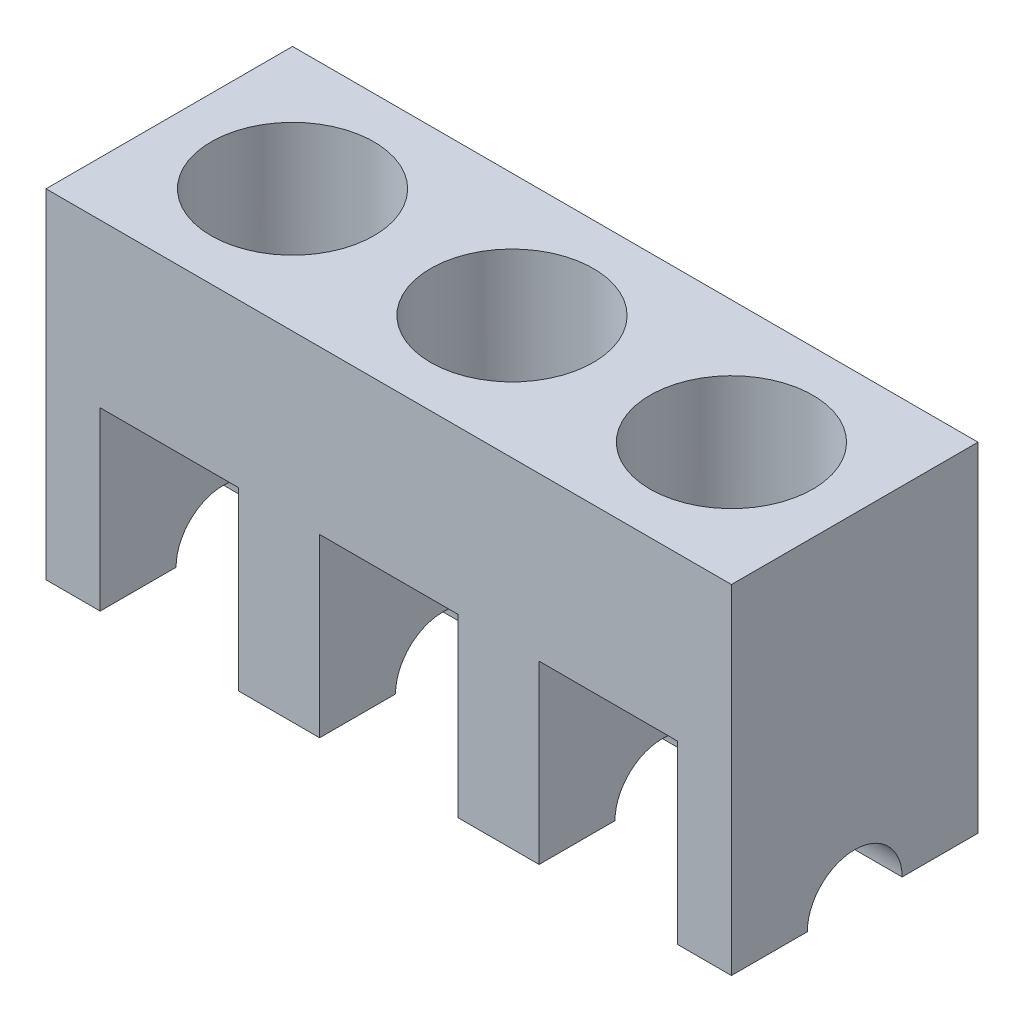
from build123d import *

# Parameters (mm, degrees)
SKETCH1_W           = 253
SKETCH1_H           = 125
BOSS_EXTRUDE1_DEPTH = 45.5
SKETCH2_W           = 51
SKETCH2_H           = 65
CUT_EXTRUDE2_DEPTH  = 91
SKETCH3_R           = 30.05
CUT_EXTRUDE3_DEPTH  = 81
CUT_EXTRUDE4_DEPTH  = 286.839552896


with BuildPart() as part:
    # Sketch1 → Boss-Extrude1 (new, symmetric)
    with BuildSketch(Plane.XY):
        with Locations((126.5, 62.5)):
            Rectangle(SKETCH1_W, SKETCH1_H)
    extrude(amount=BOSS_EXTRUDE1_DEPTH, both=True)

    # Sketch2 → Cut-Extrude2 (cut)
    with BuildSketch(Plane.XY.offset(45.5)):
        with Locations((45.5, 32.5)):
            Rectangle(SKETCH2_W, SKETCH2_H)
        with Locations((126.5, 32.5)):
            Rectangle(SKETCH2_W, SKETCH2_H)
        with Locations((207.5, 32.5)):
            Rectangle(SKETCH2_W, SKETCH2_H)
    extrude(amount=-CUT_EXTRUDE2_DEPTH, mode=Mode.SUBTRACT)

    # Sketch3 → Cut-Extrude3 (cut)
    with BuildSketch(Plane(origin=(0, 125, 0), x_dir=(1, 0, 0), z_dir=(0, 1, 0))):
        with Locations(Location((45.5, 0, 0), (0, 0, 270))):
            Circle(SKETCH3_R)
        with Locations(Location((126.5, 0, 0), (0, 0, 270))):
            Circle(SKETCH3_R)
        with Locations(Location((207.5, 0, 0), (0, 0, 270))):
            Circle(SKETCH3_R)
    extrude(amount=-CUT_EXTRUDE3_DEPTH, mode=Mode.SUBTRACT)

    # Sketch4 → Cut-Extrude4 (cut, through all)
    with BuildSketch(Plane(origin=(253, 0, 0), x_dir=(0, 0, -1), z_dir=(1, 0, 0))):
        with BuildLine():
            Line((-17.5, 0), (17.5, 0))
            ThreePointArc((17.5, 0), (0, 17.5), (-17.5, 0))
        make_face()
    extrude(amount=-CUT_EXTRUDE4_DEPTH, mode=Mode.SUBTRACT)


solid = part.part
